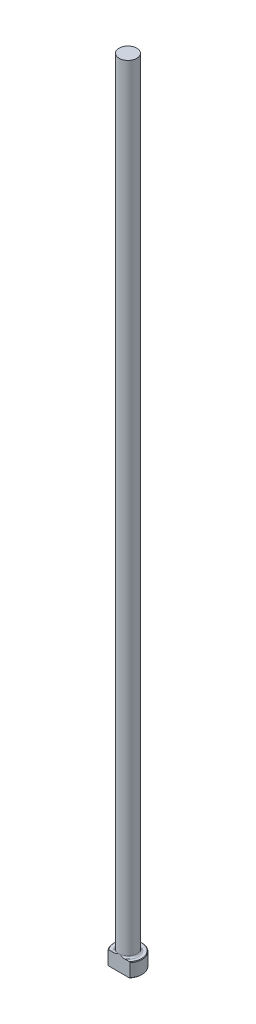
from build123d import *

# Parameters (mm, degrees)
CHAMFER1_SIZE = 0.254
FILLET1_R     = 0.762
KEY_DEPTH     = 356.713374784


with BuildPart() as part:
    # Sketch1 → Revolve1 (revolve)
    with BuildSketch(Plane.XY, mode=Mode.PRIVATE) as revolve1_sk:
        Polygon((0, 0), (-6.35, 0), (-6.35, 6.35), (-3.96875, 6.35), (-3.96875, 355.6), (0, 355.6), align=None)
    revolve(revolve1_sk.sketch.rotate(Axis((0, 259.958771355, 0), (0, -1, 0)), 270), axis=Axis((0, 259.958771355, 0), (0, -1, 0)))

    # Chamfer1
    chamfer1_edges = [part.edges().sort_by_distance(p)[0] for p in [
        (0, 6.35, -6.35),
        (0, 0, -6.35),
    ]]
    chamfer(chamfer1_edges, length=CHAMFER1_SIZE)

    # Fillet1
    fillet1_edges = [part.edges().sort_by_distance(p)[0] for p in [
        (0, 6.35, -3.96875),
    ]]
    fillet(fillet1_edges, radius=FILLET1_R)

    # Sketch2 → KEY (cut, through all)
    with BuildSketch(Plane.XZ):
        with BuildLine():
            Line((-4.956967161, 3.96875), (4.956967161, 3.96875))
            ThreePointArc((4.956967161, 3.96875), (0, 6.35), (-4.956967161, 3.96875))
        make_face()
    extrude(amount=-KEY_DEPTH, mode=Mode.SUBTRACT)


solid = part.part
